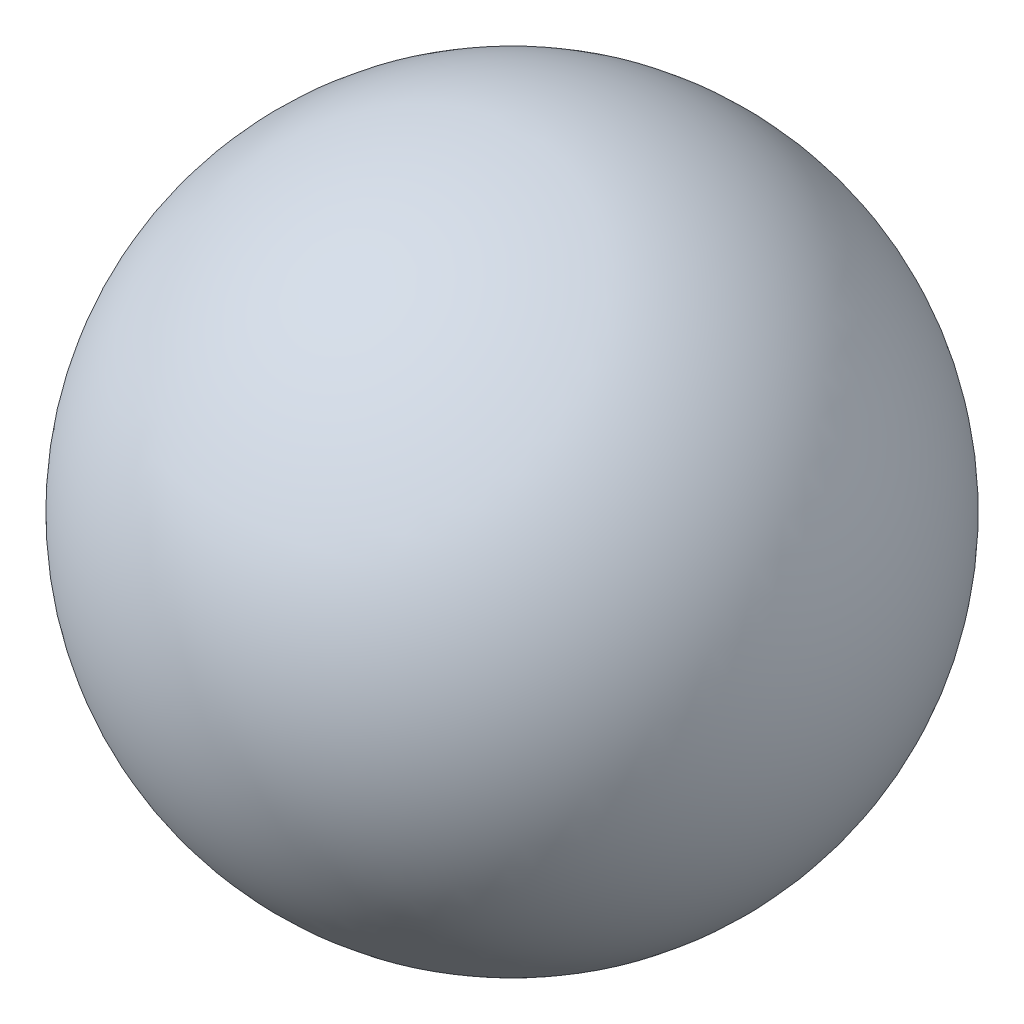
ISO-10303-21;
HEADER;
FILE_DESCRIPTION(('STEP AP214'),'2;1');
FILE_NAME('part.step','',(''),(''),'','','');
FILE_SCHEMA(('AUTOMOTIVE_DESIGN { 1 0 10303 214 1 1 1 1 }'));
ENDSEC;
DATA;
#1=APPLICATION_CONTEXT('core data for automotive mechanical design processes');
#2=APPLICATION_PROTOCOL_DEFINITION('international standard','automotive_design',2000,#1);
#3=PRODUCT_CONTEXT('',#1,'mechanical');
#4=PRODUCT('Part','Part','',(#3));
#5=PRODUCT_RELATED_PRODUCT_CATEGORY('part','',(#4));
#6=PRODUCT_DEFINITION_FORMATION('','',#4);
#7=PRODUCT_DEFINITION_CONTEXT('part definition',#1,'design');
#8=PRODUCT_DEFINITION('design','',#6,#7);
#9=PRODUCT_DEFINITION_SHAPE('','',#8);
#10=(LENGTH_UNIT() NAMED_UNIT(*) SI_UNIT(.MILLI.,.METRE.));
#11=(NAMED_UNIT(*) PLANE_ANGLE_UNIT() SI_UNIT($,.RADIAN.));
#12=(NAMED_UNIT(*) SI_UNIT($,.STERADIAN.) SOLID_ANGLE_UNIT());
#13=UNCERTAINTY_MEASURE_WITH_UNIT(LENGTH_MEASURE(1.E-05),#10,'distance_accuracy_value','');
#14=(GEOMETRIC_REPRESENTATION_CONTEXT(3) GLOBAL_UNCERTAINTY_ASSIGNED_CONTEXT((#13)) GLOBAL_UNIT_ASSIGNED_CONTEXT((#10,
#11,#12)) REPRESENTATION_CONTEXT('',''));
#15=CARTESIAN_POINT('',(0.,0.,0.));
#16=DIRECTION('',(0.,0.,1.));
#17=DIRECTION('',(1.,0.,0.));
#18=AXIS2_PLACEMENT_3D('',#15,#16,#17);
#19=CARTESIAN_POINT('',(0.,0.,0.));
#20=DIRECTION('',(0.,1.,0.));
#21=DIRECTION('',(1.,0.,0.));
#22=AXIS2_PLACEMENT_3D('',#19,#20,#21);
#23=SPHERICAL_SURFACE('',#22,1.984375);
#24=CARTESIAN_POINT('',(0.,1.984375,0.));
#25=VERTEX_POINT('',#24);
#26=VERTEX_LOOP('',#25);
#27=FACE_BOUND('',#26,.T.);
#28=ADVANCED_FACE('F35',(#27),#23,.T.);
#29=CLOSED_SHELL('',(#28));
#30=MANIFOLD_SOLID_BREP('B2',#29);
#31=ADVANCED_BREP_SHAPE_REPRESENTATION('',(#18,#30),#14);
#32=SHAPE_DEFINITION_REPRESENTATION(#9,#31);
ENDSEC;
END-ISO-10303-21;
